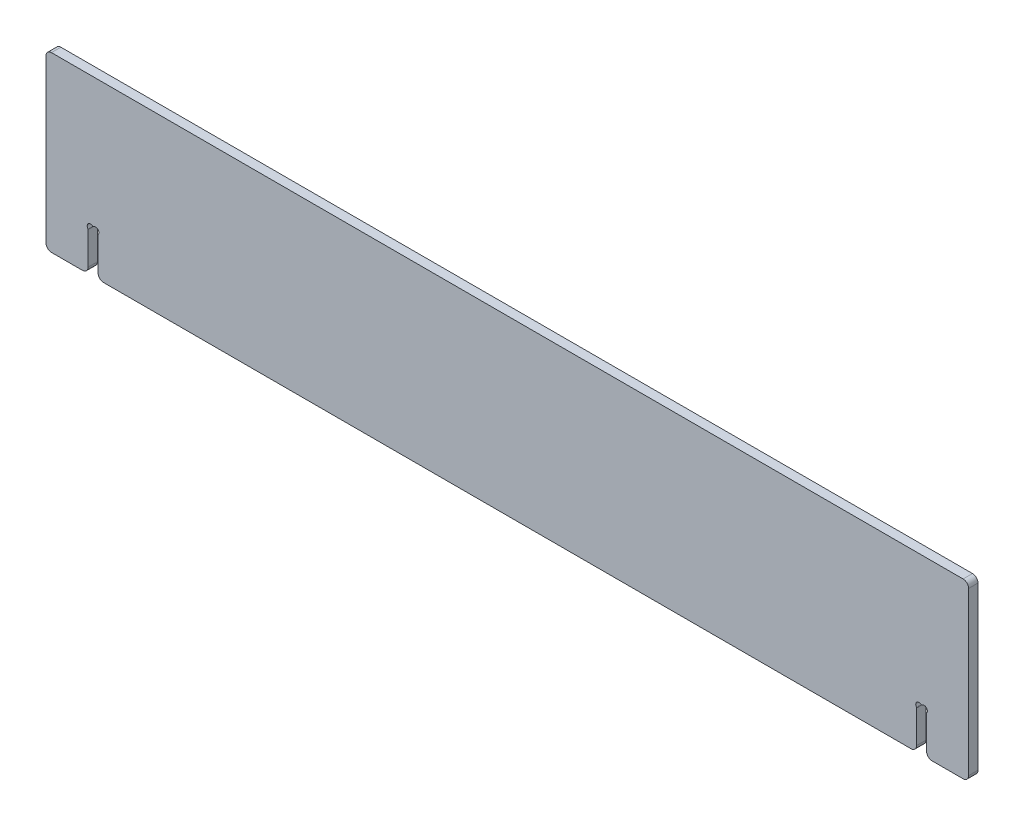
from build123d import *

# Parameters (mm, degrees)
ESQUISSE1_W         = 588.5
ESQUISSE1_H         = 220.8
BOSS_EXTRUDE1_DEPTH = 12
CUT_EXTRUDE1_DEPTH  = 629.672323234
LPATTERN1_COUNT     = 4
LPATTERN1_PITCH     = 151
CONG_1_R            = 7
BOSS_EXTRUDE2_START = -12
BOSS_EXTRUDE2_DEPTH = 12


with BuildPart() as part:
    # Esquisse1 → Boss-Extrude1 (new body)
    with BuildSketch(Plane.XY):
        with Locations((294.25, 110.4)):
            Rectangle(ESQUISSE1_W, ESQUISSE1_H)
    extrude(amount=BOSS_EXTRUDE1_DEPTH)

    # Esquisse2 → Cut-Extrude1 (cut, through all)
    with BuildSketch(Plane.XY.offset(12)):
        with BuildLine():
            Line((59.867332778, 55.2), (60.132667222, 55.2))
            ThreePointArc((60.132667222, 55.2), (60.514806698, 55.262472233), (60.857157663, 55.443384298))
            ThreePointArc((60.857157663, 55.443384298), (66.321786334, 54.981041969), (66.438077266, 49.498122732))
            ThreePointArc((66.438077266, 49.498122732), (66.220633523, 49.128471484), (66.147058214, 48.705966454))
            Line((66.147058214, 48.705966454), (66.5, 0))
            Line((66.5, 0), (53.5, 0))
            Line((53.5, 0), (53.852941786, 48.705966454))
            ThreePointArc((53.852941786, 48.705966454), (53.779366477, 49.128471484), (53.561922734, 49.498122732))
            ThreePointArc((53.561922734, 49.498122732), (53.678213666, 54.981041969), (59.142842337, 55.443384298))
            ThreePointArc((59.142842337, 55.443384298), (59.485193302, 55.262472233), (59.867332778, 55.2))
        make_face()
    cut_extrude1 = extrude(amount=-CUT_EXTRUDE1_DEPTH, mode=Mode.SUBTRACT)

    # Mirror1: Cut-Extrude1 across plane
    add(cut_extrude1.mirror(Plane.ZX.offset(110.4)), mode=Mode.SUBTRACT)

    # LPattern1: Cut-Extrude1 ×4
    with Locations(*[(i * LPATTERN1_PITCH, 0, 0) for i in range(1, LPATTERN1_COUNT)]):
        add(cut_extrude1, mode=Mode.SUBTRACT)

    # Cong_1
    cong_1_edges = [part.edges().sort_by_distance(p)[0] for p in [
        (368.5, 0, 6),
        (355.5, 0, 6),
        (519.5, 0, 6),
        (506.5, 0, 6),
        (66.5, 0, 6),
        (53.5, 0, 6),
        (53.5, 220.8, 6),
        (66.5, 220.8, 6),
        (0, 220.8, 6),
        (0, 0, 6),
        (217.5, 0, 6),
        (204.5, 0, 6),
    ]]
    fillet(cong_1_edges, radius=CONG_1_R)

    # Sym_trie1: part across plane


with BuildPart() as part_1:
    add(part.part)
    add(part.part.mirror(Plane(origin=(588.5, 0, 12), x_dir=(0, 0, 1), z_dir=(-1, 0, 0))))

    # Sketch4 → Boss-Extrude2 (add)
    with BuildSketch(Plane(origin=(0, 0, 0), x_dir=(-1, 0, 0), z_dir=(0, 0, -1)).offset(BOSS_EXTRUDE2_START)):
        with BuildLine():
            Line((0, 110.4), (-135.5, 110.4))
            Line((-135.5, 110.4), (-135.5, 0))
            Line((-135.5, 0), (-1041.5, 0))
            Line((-1041.5, 0), (-1041.5, 110.4))
            Line((-1041.5, 110.4), (-1177, 110.4))
            Line((-1177, 110.4), (-1177, 213.8))
            ThreePointArc((-1177, 213.8), (-1174.949747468, 218.749747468), (-1170, 220.8))
            Line((-1170, 220.8), (-7, 220.8))
            ThreePointArc((-7, 220.8), (-2.050252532, 218.749747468), (0, 213.8))
            Line((0, 213.8), (0, 110.4))
        make_face()
    extrude(amount=BOSS_EXTRUDE2_DEPTH)


solid = part_1.part
